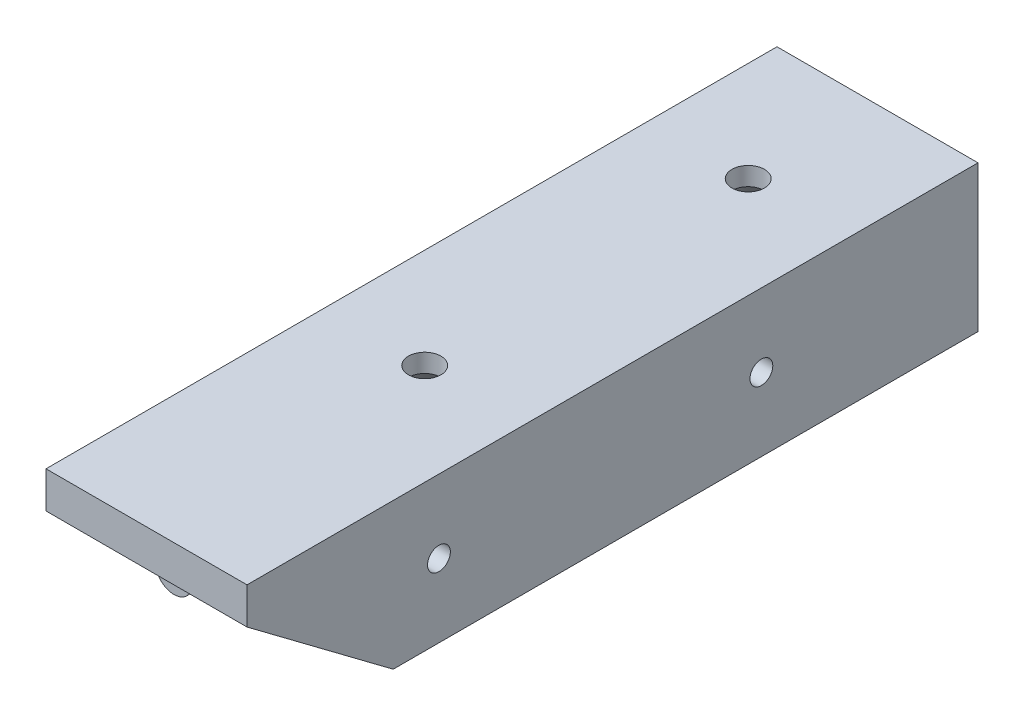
from build123d import *

# Parameters (mm, degrees)
BOSS_EXTRUDE1_DEPTH                           = 40
CUT_EXTRUDE1_DEPTH                            = 15
SKETCH4_R                                     = 0.625
CUT_EXTRUDE6_DEPTH                            = 2
SKETCH5_R                                     = 0.625
CUT_EXTRUDE3_DEPTH                            = 3
SKETCH9_W                                     = 2
SKETCH9_H                                     = 1
BOSS_EXTRUDE4_DEPTH                           = 2
SKETCH13_R                                    = 1.5
SKETCH13_R_2                                  = 0.622386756
SKETCH13_R_3                                  = 0.625
BOSS_EXTRUDE6_DEPTH                           = 2
SKETCH14_R                                    = 1.5
SKETCH14_R_2                                  = 0.625
BOSS_EXTRUDE7_DEPTH                           = 2
CSK_FOR_0_FLAT_HEAD_SOCKET_CAP_SCREW2_A_COUNT = 2
CSK_FOR_0_FLAT_HEAD_SOCKET_CAP_SCREW2_A_PITCH = 17.701783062
CUT_EXTRUDE7_DEPTH                            = 20
CUT_EXTRUDE7_DEPTH_BACK                       = 20


with BuildPart() as part:
    # Sketch1 → Boss-Extrude1 (new body)
    with BuildSketch(Plane.XY):
        Polygon((-33.503393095, -0.782769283), (-33.503393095, 7.217230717), (-22.503393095, 7.217230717), (-22.503393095, -0.782769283), (-24.503393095, -0.782769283), (-24.503393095, 5.217230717), (-31.503393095, 5.217230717), (-31.503393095, -0.782769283), align=None)
    extrude(amount=BOSS_EXTRUDE1_DEPTH)

    # Sketch3 → Cut-Extrude1 (cut)
    with BuildSketch(Plane(origin=(-22.503393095, 0, 0), x_dir=(0, 0, -1), z_dir=(1, 0, 0))):
        Polygon((-32, -0.782769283), (-40, 5.217230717), (-40, -0.782769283), align=None)
    extrude(amount=-CUT_EXTRUDE1_DEPTH, mode=Mode.SUBTRACT)

    # Sketch4 → Cut-Extrude6 (cut)
    with BuildSketch(Plane(origin=(-22.503393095, 0, 0), x_dir=(0, 0, -1), z_dir=(1, 0, 0))):
        with Locations((-29.497400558, 3.217230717)):
            Circle(SKETCH4_R)
        with Locations((-11.853861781, 3.217230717)):
            Circle(SKETCH4_R)
    extrude(amount=-CUT_EXTRUDE6_DEPTH, mode=Mode.SUBTRACT)

    # Sketch5 → Cut-Extrude3 (cut)
    with BuildSketch(Plane.ZY.offset(33.503393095)):
        with Locations((11.872513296, 3.217230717)):
            Circle(SKETCH5_R)
        with Locations((29.469675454, 3.217230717)):
            Circle(SKETCH5_R)
    extrude(amount=-CUT_EXTRUDE3_DEPTH, mode=Mode.SUBTRACT)

    # Sketch9 → Boss-Extrude4 (add)
    with BuildSketch(Plane(origin=(0, 5.217230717, 0), x_dir=(-1, 0, 0), z_dir=(0, -1, 0))):
        with Locations((28.003393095, -20.5)):
            Rectangle(SKETCH9_W, SKETCH9_H)
        with Locations((28.003393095, -38)):
            Rectangle(SKETCH9_W, SKETCH9_H)
        with Locations((28.003393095, -2.804567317)):
            Rectangle(SKETCH9_W, SKETCH9_H)
    extrude(amount=BOSS_EXTRUDE4_DEPTH)

    # Sketch13 → Boss-Extrude6 (add)
    # profile 1 of 2: a face of its own
    with BuildSketch(Plane.ZY.offset(24.503393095)):
        with Locations(Location((29.497400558, 3.217230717, 0), (0, 0, 180))):
            Circle(SKETCH13_R)
        with Locations((29.497400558, 3.217230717)):
            Circle(SKETCH13_R_2, mode=Mode.SUBTRACT)
    # profile 2 of 2: a face of its own
    with BuildSketch(Plane.ZY.offset(24.503393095)):
        with Locations(Location((11.853861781, 3.217230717, 0), (0, 0, 180))):
            Circle(SKETCH13_R)
        with Locations(Location((11.853861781, 3.217230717, 0), (0, 0, 180))):
            Circle(SKETCH13_R_3, mode=Mode.SUBTRACT)
    extrude(amount=BOSS_EXTRUDE6_DEPTH)

    # Sketch14 → Boss-Extrude7 (add)
    # profile 1 of 2: a face of its own
    with BuildSketch(Plane(origin=(-31.503393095, 0, 0), x_dir=(0, 0, -1), z_dir=(1, 0, 0))):
        with Locations(Location((-29.469675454, 3.217230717, 0), (0, 0, 180))):
            Circle(SKETCH14_R)
        with Locations(Location((-29.469675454, 3.217230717, 0), (0, 0, 180))):
            Circle(SKETCH14_R_2, mode=Mode.SUBTRACT)
    # profile 2 of 2: a face of its own
    with BuildSketch(Plane(origin=(-31.503393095, 0, 0), x_dir=(0, 0, -1), z_dir=(1, 0, 0))):
        with Locations(Location((-11.872513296, 3.217230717, 0), (0, 0, 180))):
            Circle(SKETCH14_R)
        with Locations(Location((-11.872513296, 3.217230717, 0), (0, 0, 180))):
            Circle(SKETCH14_R_2, mode=Mode.SUBTRACT)
    extrude(amount=BOSS_EXTRUDE7_DEPTH)

    # Sketch17 → CSK for _0 Flat Head Socket Cap Screw2 (revolve, cut)
    with BuildSketch(Plane(origin=(-28.038082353, 5.217230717, 24.742291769), x_dir=(0, 0, -1), z_dir=(1, 0, 0))):
        Polygon((0, 0), (0, 2), (0.889, 2), (0.889, 0.993458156), (1.7526, 0), align=None)
    csk_for_0_flat_head_socket_cap_screw2 = revolve(axis=Axis((-28.038082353, -1.132769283, 24.742291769), (0, 1, 0)), mode=Mode.SUBTRACT)

    # CSK for _0 Flat Head Socket Cap Screw2 a: CSK for _0 Flat Head Socket Cap Screw2 ×2
    with Locations(*[(0, 0, -i * CSK_FOR_0_FLAT_HEAD_SOCKET_CAP_SCREW2_A_PITCH) for i in range(1, CSK_FOR_0_FLAT_HEAD_SOCKET_CAP_SCREW2_A_COUNT)]):
        add(csk_for_0_flat_head_socket_cap_screw2, mode=Mode.SUBTRACT)

    # Sketch10 → Cut-Extrude7 (cut, two sides: drawn at the far end of the back side and taken through both)
    with BuildSketch(Plane(origin=(0, 0, 20), x_dir=(-1, 0, 0), z_dir=(0, 0, -1)).offset(-CUT_EXTRUDE7_DEPTH_BACK)):
        with BuildLine():
            Line((29.003393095, 4.217230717), (29.003393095, 3.217230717))
            Line((29.003393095, 3.217230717), (27.003393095, 3.217230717))
            Line((27.003393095, 3.217230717), (27.003393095, 4.217230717))
            ThreePointArc((27.003393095, 4.217230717), (28.003393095, 3.258090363), (29.003393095, 4.217230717))
        make_face()
    extrude(amount=CUT_EXTRUDE7_DEPTH + CUT_EXTRUDE7_DEPTH_BACK, mode=Mode.SUBTRACT)


solid = part.part
